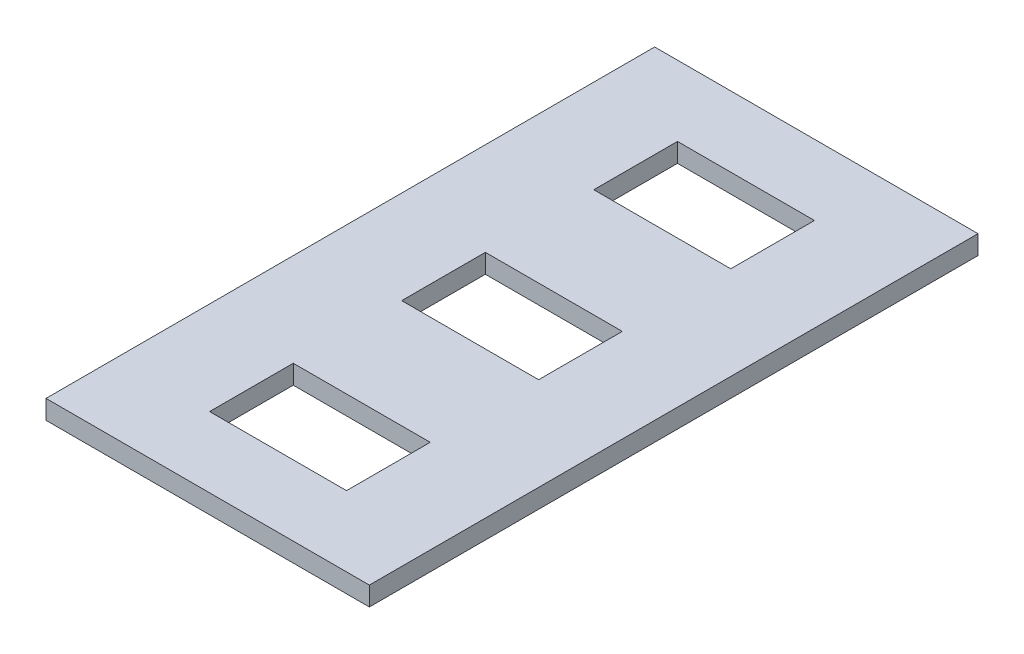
ISO-10303-21;
HEADER;
FILE_DESCRIPTION(('STEP AP214'),'2;1');
FILE_NAME('part.step','',(''),(''),'','','');
FILE_SCHEMA(('AUTOMOTIVE_DESIGN { 1 0 10303 214 1 1 1 1 }'));
ENDSEC;
DATA;
#1=APPLICATION_CONTEXT('core data for automotive mechanical design processes');
#2=APPLICATION_PROTOCOL_DEFINITION('international standard','automotive_design',2000,#1);
#3=PRODUCT_CONTEXT('',#1,'mechanical');
#4=PRODUCT('Part','Part','',(#3));
#5=PRODUCT_RELATED_PRODUCT_CATEGORY('part','',(#4));
#6=PRODUCT_DEFINITION_FORMATION('','',#4);
#7=PRODUCT_DEFINITION_CONTEXT('part definition',#1,'design');
#8=PRODUCT_DEFINITION('design','',#6,#7);
#9=PRODUCT_DEFINITION_SHAPE('','',#8);
#10=(LENGTH_UNIT() NAMED_UNIT(*) SI_UNIT(.MILLI.,.METRE.));
#11=(NAMED_UNIT(*) PLANE_ANGLE_UNIT() SI_UNIT($,.RADIAN.));
#12=(NAMED_UNIT(*) SI_UNIT($,.STERADIAN.) SOLID_ANGLE_UNIT());
#13=UNCERTAINTY_MEASURE_WITH_UNIT(LENGTH_MEASURE(1.E-05),#10,'distance_accuracy_value','');
#14=(GEOMETRIC_REPRESENTATION_CONTEXT(3) GLOBAL_UNCERTAINTY_ASSIGNED_CONTEXT((#13)) GLOBAL_UNIT_ASSIGNED_CONTEXT((#10,
#11,#12)) REPRESENTATION_CONTEXT('',''));
#15=CARTESIAN_POINT('',(0.,0.,0.));
#16=DIRECTION('',(0.,0.,1.));
#17=DIRECTION('',(1.,0.,0.));
#18=AXIS2_PLACEMENT_3D('',#15,#16,#17);
#19=CARTESIAN_POINT('',(0.,5.,0.));
#20=DIRECTION('',(0.,1.,0.));
#21=DIRECTION('',(0.,0.,1.));
#22=AXIS2_PLACEMENT_3D('',#19,#20,#21);
#23=PLANE('',#22);
#24=DIRECTION('',(0.,0.,-1.));
#25=VECTOR('',#24,1.);
#26=CARTESIAN_POINT('',(42.5,5.,-80.));
#27=LINE('',#26,#25);
#28=CARTESIAN_POINT('',(42.5,5.,80.));
#29=VERTEX_POINT('',#28);
#30=CARTESIAN_POINT('',(42.5,5.,-80.));
#31=VERTEX_POINT('',#30);
#32=EDGE_CURVE('E287',#29,#31,#27,.T.);
#33=ORIENTED_EDGE('',*,*,#32,.T.);
#34=DIRECTION('',(-1.,0.,0.));
#35=VECTOR('',#34,1.);
#36=CARTESIAN_POINT('',(-42.5,5.,-80.));
#37=LINE('',#36,#35);
#38=CARTESIAN_POINT('',(-42.5,5.,-80.));
#39=VERTEX_POINT('',#38);
#40=EDGE_CURVE('E291',#31,#39,#37,.T.);
#41=ORIENTED_EDGE('',*,*,#40,.T.);
#42=DIRECTION('',(0.,0.,1.));
#43=VECTOR('',#42,1.);
#44=CARTESIAN_POINT('',(-42.5,5.,-80.));
#45=LINE('',#44,#43);
#46=CARTESIAN_POINT('',(-42.5,5.,80.));
#47=VERTEX_POINT('',#46);
#48=EDGE_CURVE('E295',#39,#47,#45,.T.);
#49=ORIENTED_EDGE('',*,*,#48,.T.);
#50=DIRECTION('',(1.,0.,0.));
#51=VECTOR('',#50,1.);
#52=CARTESIAN_POINT('',(-42.5,5.,80.));
#53=LINE('',#52,#51);
#54=EDGE_CURVE('E298',#47,#29,#53,.T.);
#55=ORIENTED_EDGE('',*,*,#54,.T.);
#56=EDGE_LOOP('',(#33,#41,#49,#55));
#57=FACE_BOUND('',#56,.T.);
#58=DIRECTION('',(-1.,0.,0.));
#59=VECTOR('',#58,1.);
#60=CARTESIAN_POINT('',(-18.,5.,-11.));
#61=LINE('',#60,#59);
#62=CARTESIAN_POINT('',(18.,5.,-11.));
#63=VERTEX_POINT('',#62);
#64=CARTESIAN_POINT('',(-18.,5.,-11.));
#65=VERTEX_POINT('',#64);
#66=EDGE_CURVE('E247',#63,#65,#61,.T.);
#67=ORIENTED_EDGE('',*,*,#66,.F.);
#68=DIRECTION('',(0.,0.,-1.));
#69=VECTOR('',#68,1.);
#70=CARTESIAN_POINT('',(18.,5.,-11.));
#71=LINE('',#70,#69);
#72=CARTESIAN_POINT('',(18.,5.,11.));
#73=VERTEX_POINT('',#72);
#74=EDGE_CURVE('E244',#73,#63,#71,.T.);
#75=ORIENTED_EDGE('',*,*,#74,.F.);
#76=DIRECTION('',(1.,0.,0.));
#77=VECTOR('',#76,1.);
#78=CARTESIAN_POINT('',(-18.,5.,11.));
#79=LINE('',#78,#77);
#80=CARTESIAN_POINT('',(-18.,5.,11.));
#81=VERTEX_POINT('',#80);
#82=EDGE_CURVE('E255',#81,#73,#79,.T.);
#83=ORIENTED_EDGE('',*,*,#82,.F.);
#84=DIRECTION('',(0.,0.,1.));
#85=VECTOR('',#84,1.);
#86=CARTESIAN_POINT('',(-18.,5.,-11.));
#87=LINE('',#86,#85);
#88=EDGE_CURVE('E251',#65,#81,#87,.T.);
#89=ORIENTED_EDGE('',*,*,#88,.F.);
#90=EDGE_LOOP('',(#67,#75,#83,#89));
#91=FACE_BOUND('',#90,.T.);
#92=DIRECTION('',(-1.,0.,0.));
#93=VECTOR('',#92,1.);
#94=CARTESIAN_POINT('',(-18.,5.,-61.5));
#95=LINE('',#94,#93);
#96=CARTESIAN_POINT('',(18.,5.,-61.5));
#97=VERTEX_POINT('',#96);
#98=CARTESIAN_POINT('',(-18.,5.,-61.5));
#99=VERTEX_POINT('',#98);
#100=EDGE_CURVE('E204',#97,#99,#95,.T.);
#101=ORIENTED_EDGE('',*,*,#100,.F.);
#102=DIRECTION('',(0.,0.,-1.));
#103=VECTOR('',#102,1.);
#104=CARTESIAN_POINT('',(18.,5.,-61.5));
#105=LINE('',#104,#103);
#106=CARTESIAN_POINT('',(18.,5.,-39.5));
#107=VERTEX_POINT('',#106);
#108=EDGE_CURVE('E201',#107,#97,#105,.T.);
#109=ORIENTED_EDGE('',*,*,#108,.F.);
#110=DIRECTION('',(1.,0.,0.));
#111=VECTOR('',#110,1.);
#112=CARTESIAN_POINT('',(-18.,5.,-39.5));
#113=LINE('',#112,#111);
#114=CARTESIAN_POINT('',(-18.,5.,-39.5));
#115=VERTEX_POINT('',#114);
#116=EDGE_CURVE('E212',#115,#107,#113,.T.);
#117=ORIENTED_EDGE('',*,*,#116,.F.);
#118=DIRECTION('',(0.,0.,1.));
#119=VECTOR('',#118,1.);
#120=CARTESIAN_POINT('',(-18.,5.,-61.5));
#121=LINE('',#120,#119);
#122=EDGE_CURVE('E208',#99,#115,#121,.T.);
#123=ORIENTED_EDGE('',*,*,#122,.F.);
#124=EDGE_LOOP('',(#101,#109,#117,#123));
#125=FACE_BOUND('',#124,.T.);
#126=DIRECTION('',(-1.,0.,0.));
#127=VECTOR('',#126,1.);
#128=CARTESIAN_POINT('',(-18.,5.,39.5));
#129=LINE('',#128,#127);
#130=CARTESIAN_POINT('',(18.,5.,39.5));
#131=VERTEX_POINT('',#130);
#132=CARTESIAN_POINT('',(-18.,5.,39.5));
#133=VERTEX_POINT('',#132);
#134=EDGE_CURVE('E162',#131,#133,#129,.T.);
#135=ORIENTED_EDGE('',*,*,#134,.F.);
#136=DIRECTION('',(0.,0.,-1.));
#137=VECTOR('',#136,1.);
#138=CARTESIAN_POINT('',(18.,5.,39.5));
#139=LINE('',#138,#137);
#140=CARTESIAN_POINT('',(18.,5.,61.5));
#141=VERTEX_POINT('',#140);
#142=EDGE_CURVE('E153',#141,#131,#139,.T.);
#143=ORIENTED_EDGE('',*,*,#142,.F.);
#144=DIRECTION('',(1.,0.,0.));
#145=VECTOR('',#144,1.);
#146=CARTESIAN_POINT('',(-18.,5.,61.5));
#147=LINE('',#146,#145);
#148=CARTESIAN_POINT('',(-18.,5.,61.5));
#149=VERTEX_POINT('',#148);
#150=EDGE_CURVE('E179',#149,#141,#147,.T.);
#151=ORIENTED_EDGE('',*,*,#150,.F.);
#152=DIRECTION('',(0.,0.,1.));
#153=VECTOR('',#152,1.);
#154=CARTESIAN_POINT('',(-18.,5.,39.5));
#155=LINE('',#154,#153);
#156=EDGE_CURVE('E175',#133,#149,#155,.T.);
#157=ORIENTED_EDGE('',*,*,#156,.F.);
#158=EDGE_LOOP('',(#135,#143,#151,#157));
#159=FACE_BOUND('',#158,.T.);
#160=ADVANCED_FACE('F39',(#57,#91,#125,#159),#23,.T.);
#161=CARTESIAN_POINT('',(0.,0.,0.));
#162=DIRECTION('',(0.,1.,0.));
#163=DIRECTION('',(0.,0.,1.));
#164=AXIS2_PLACEMENT_3D('',#161,#162,#163);
#165=PLANE('',#164);
#166=DIRECTION('',(0.,0.,-1.));
#167=VECTOR('',#166,1.);
#168=CARTESIAN_POINT('',(18.,0.,-61.5));
#169=LINE('',#168,#167);
#170=CARTESIAN_POINT('',(18.,0.,-39.5));
#171=VERTEX_POINT('',#170);
#172=CARTESIAN_POINT('',(18.,0.,-61.5));
#173=VERTEX_POINT('',#172);
#174=EDGE_CURVE('E171',#171,#173,#169,.T.);
#175=ORIENTED_EDGE('',*,*,#174,.T.);
#176=DIRECTION('',(-1.,0.,0.));
#177=VECTOR('',#176,1.);
#178=CARTESIAN_POINT('',(-18.,0.,-61.5));
#179=LINE('',#178,#177);
#180=CARTESIAN_POINT('',(-18.,0.,-61.5));
#181=VERTEX_POINT('',#180);
#182=EDGE_CURVE('E219',#173,#181,#179,.T.);
#183=ORIENTED_EDGE('',*,*,#182,.T.);
#184=DIRECTION('',(0.,0.,1.));
#185=VECTOR('',#184,1.);
#186=CARTESIAN_POINT('',(-18.,0.,-61.5));
#187=LINE('',#186,#185);
#188=CARTESIAN_POINT('',(-18.,0.,-39.5));
#189=VERTEX_POINT('',#188);
#190=EDGE_CURVE('E223',#181,#189,#187,.T.);
#191=ORIENTED_EDGE('',*,*,#190,.T.);
#192=DIRECTION('',(1.,0.,0.));
#193=VECTOR('',#192,1.);
#194=CARTESIAN_POINT('',(-18.,0.,-39.5));
#195=LINE('',#194,#193);
#196=EDGE_CURVE('E205',#189,#171,#195,.T.);
#197=ORIENTED_EDGE('',*,*,#196,.T.);
#198=EDGE_LOOP('',(#175,#183,#191,#197));
#199=FACE_BOUND('',#198,.T.);
#200=DIRECTION('',(0.,0.,-1.));
#201=VECTOR('',#200,1.);
#202=CARTESIAN_POINT('',(42.5,0.,-80.));
#203=LINE('',#202,#201);
#204=CARTESIAN_POINT('',(42.5,0.,80.));
#205=VERTEX_POINT('',#204);
#206=CARTESIAN_POINT('',(42.5,0.,-80.));
#207=VERTEX_POINT('',#206);
#208=EDGE_CURVE('E286',#205,#207,#203,.T.);
#209=ORIENTED_EDGE('',*,*,#208,.F.);
#210=DIRECTION('',(1.,0.,0.));
#211=VECTOR('',#210,1.);
#212=CARTESIAN_POINT('',(-42.5,0.,80.));
#213=LINE('',#212,#211);
#214=CARTESIAN_POINT('',(-42.5,0.,80.));
#215=VERTEX_POINT('',#214);
#216=EDGE_CURVE('E292',#215,#205,#213,.T.);
#217=ORIENTED_EDGE('',*,*,#216,.F.);
#218=DIRECTION('',(0.,0.,1.));
#219=VECTOR('',#218,1.);
#220=CARTESIAN_POINT('',(-42.5,0.,-80.));
#221=LINE('',#220,#219);
#222=CARTESIAN_POINT('',(-42.5,0.,-80.));
#223=VERTEX_POINT('',#222);
#224=EDGE_CURVE('E308',#223,#215,#221,.T.);
#225=ORIENTED_EDGE('',*,*,#224,.F.);
#226=DIRECTION('',(-1.,0.,0.));
#227=VECTOR('',#226,1.);
#228=CARTESIAN_POINT('',(-42.5,0.,-80.));
#229=LINE('',#228,#227);
#230=EDGE_CURVE('E305',#207,#223,#229,.T.);
#231=ORIENTED_EDGE('',*,*,#230,.F.);
#232=EDGE_LOOP('',(#209,#217,#225,#231));
#233=FACE_BOUND('',#232,.T.);
#234=DIRECTION('',(0.,0.,-1.));
#235=VECTOR('',#234,1.);
#236=CARTESIAN_POINT('',(18.,0.,-11.));
#237=LINE('',#236,#235);
#238=CARTESIAN_POINT('',(18.,0.,11.));
#239=VERTEX_POINT('',#238);
#240=CARTESIAN_POINT('',(18.,0.,-11.));
#241=VERTEX_POINT('',#240);
#242=EDGE_CURVE('E243',#239,#241,#237,.T.);
#243=ORIENTED_EDGE('',*,*,#242,.T.);
#244=DIRECTION('',(-1.,0.,0.));
#245=VECTOR('',#244,1.);
#246=CARTESIAN_POINT('',(-18.,0.,-11.));
#247=LINE('',#246,#245);
#248=CARTESIAN_POINT('',(-18.,0.,-11.));
#249=VERTEX_POINT('',#248);
#250=EDGE_CURVE('E262',#241,#249,#247,.T.);
#251=ORIENTED_EDGE('',*,*,#250,.T.);
#252=DIRECTION('',(0.,0.,1.));
#253=VECTOR('',#252,1.);
#254=CARTESIAN_POINT('',(-18.,0.,-11.));
#255=LINE('',#254,#253);
#256=CARTESIAN_POINT('',(-18.,0.,11.));
#257=VERTEX_POINT('',#256);
#258=EDGE_CURVE('E266',#249,#257,#255,.T.);
#259=ORIENTED_EDGE('',*,*,#258,.T.);
#260=DIRECTION('',(1.,0.,0.));
#261=VECTOR('',#260,1.);
#262=CARTESIAN_POINT('',(-18.,0.,11.));
#263=LINE('',#262,#261);
#264=EDGE_CURVE('E248',#257,#239,#263,.T.);
#265=ORIENTED_EDGE('',*,*,#264,.T.);
#266=EDGE_LOOP('',(#243,#251,#259,#265));
#267=FACE_BOUND('',#266,.T.);
#268=DIRECTION('',(0.,0.,-1.));
#269=VECTOR('',#268,1.);
#270=CARTESIAN_POINT('',(18.,0.,39.5));
#271=LINE('',#270,#269);
#272=CARTESIAN_POINT('',(18.,0.,61.5));
#273=VERTEX_POINT('',#272);
#274=CARTESIAN_POINT('',(18.,0.,39.5));
#275=VERTEX_POINT('',#274);
#276=EDGE_CURVE('E63',#273,#275,#271,.T.);
#277=ORIENTED_EDGE('',*,*,#276,.T.);
#278=DIRECTION('',(-1.,0.,0.));
#279=VECTOR('',#278,1.);
#280=CARTESIAN_POINT('',(-18.,0.,39.5));
#281=LINE('',#280,#279);
#282=CARTESIAN_POINT('',(-18.,0.,39.5));
#283=VERTEX_POINT('',#282);
#284=EDGE_CURVE('E169',#275,#283,#281,.T.);
#285=ORIENTED_EDGE('',*,*,#284,.T.);
#286=DIRECTION('',(0.,0.,1.));
#287=VECTOR('',#286,1.);
#288=CARTESIAN_POINT('',(-18.,0.,39.5));
#289=LINE('',#288,#287);
#290=CARTESIAN_POINT('',(-18.,0.,61.5));
#291=VERTEX_POINT('',#290);
#292=EDGE_CURVE('E188',#283,#291,#289,.T.);
#293=ORIENTED_EDGE('',*,*,#292,.T.);
#294=DIRECTION('',(1.,0.,0.));
#295=VECTOR('',#294,1.);
#296=CARTESIAN_POINT('',(-18.,0.,61.5));
#297=LINE('',#296,#295);
#298=EDGE_CURVE('E163',#291,#273,#297,.T.);
#299=ORIENTED_EDGE('',*,*,#298,.T.);
#300=EDGE_LOOP('',(#277,#285,#293,#299));
#301=FACE_BOUND('',#300,.T.);
#302=ADVANCED_FACE('F331',(#199,#233,#267,#301),#165,.F.);
#303=CARTESIAN_POINT('',(42.5,5.,-80.));
#304=DIRECTION('',(-1.,0.,0.));
#305=DIRECTION('',(0.,0.,1.));
#306=AXIS2_PLACEMENT_3D('',#303,#304,#305);
#307=PLANE('',#306);
#308=ORIENTED_EDGE('',*,*,#208,.T.);
#309=DIRECTION('',(0.,-1.,0.));
#310=VECTOR('',#309,1.);
#311=CARTESIAN_POINT('',(42.5,5.,-80.));
#312=LINE('',#311,#310);
#313=EDGE_CURVE('E11',#31,#207,#312,.T.);
#314=ORIENTED_EDGE('',*,*,#313,.F.);
#315=ORIENTED_EDGE('',*,*,#32,.F.);
#316=DIRECTION('',(0.,-1.,0.));
#317=VECTOR('',#316,1.);
#318=CARTESIAN_POINT('',(42.5,5.,80.));
#319=LINE('',#318,#317);
#320=EDGE_CURVE('E301',#29,#205,#319,.T.);
#321=ORIENTED_EDGE('',*,*,#320,.T.);
#322=EDGE_LOOP('',(#308,#314,#315,#321));
#323=FACE_BOUND('',#322,.T.);
#324=ADVANCED_FACE('F41',(#323),#307,.F.);
#325=CARTESIAN_POINT('',(-42.5,5.,-80.));
#326=DIRECTION('',(0.,0.,1.));
#327=DIRECTION('',(1.,0.,0.));
#328=AXIS2_PLACEMENT_3D('',#325,#326,#327);
#329=PLANE('',#328);
#330=ORIENTED_EDGE('',*,*,#230,.T.);
#331=DIRECTION('',(0.,-1.,0.));
#332=VECTOR('',#331,1.);
#333=CARTESIAN_POINT('',(-42.5,5.,-80.));
#334=LINE('',#333,#332);
#335=EDGE_CURVE('E48',#39,#223,#334,.T.);
#336=ORIENTED_EDGE('',*,*,#335,.F.);
#337=ORIENTED_EDGE('',*,*,#40,.F.);
#338=ORIENTED_EDGE('',*,*,#313,.T.);
#339=EDGE_LOOP('',(#330,#336,#337,#338));
#340=FACE_BOUND('',#339,.T.);
#341=ADVANCED_FACE('F342',(#340),#329,.F.);
#342=CARTESIAN_POINT('',(-42.5,5.,-80.));
#343=DIRECTION('',(1.,0.,0.));
#344=DIRECTION('',(0.,0.,-1.));
#345=AXIS2_PLACEMENT_3D('',#342,#343,#344);
#346=PLANE('',#345);
#347=ORIENTED_EDGE('',*,*,#224,.T.);
#348=DIRECTION('',(0.,-1.,0.));
#349=VECTOR('',#348,1.);
#350=CARTESIAN_POINT('',(-42.5,5.,80.));
#351=LINE('',#350,#349);
#352=EDGE_CURVE('E316',#47,#215,#351,.T.);
#353=ORIENTED_EDGE('',*,*,#352,.F.);
#354=ORIENTED_EDGE('',*,*,#48,.F.);
#355=ORIENTED_EDGE('',*,*,#335,.T.);
#356=EDGE_LOOP('',(#347,#353,#354,#355));
#357=FACE_BOUND('',#356,.T.);
#358=ADVANCED_FACE('F325',(#357),#346,.F.);
#359=CARTESIAN_POINT('',(-42.5,5.,80.));
#360=DIRECTION('',(0.,0.,-1.));
#361=DIRECTION('',(-1.,0.,0.));
#362=AXIS2_PLACEMENT_3D('',#359,#360,#361);
#363=PLANE('',#362);
#364=ORIENTED_EDGE('',*,*,#216,.T.);
#365=ORIENTED_EDGE('',*,*,#320,.F.);
#366=ORIENTED_EDGE('',*,*,#54,.F.);
#367=ORIENTED_EDGE('',*,*,#352,.T.);
#368=EDGE_LOOP('',(#364,#365,#366,#367));
#369=FACE_BOUND('',#368,.T.);
#370=ADVANCED_FACE('F335',(#369),#363,.F.);
#371=CARTESIAN_POINT('',(18.,5.,-11.));
#372=DIRECTION('',(-1.,0.,0.));
#373=DIRECTION('',(0.,0.,1.));
#374=AXIS2_PLACEMENT_3D('',#371,#372,#373);
#375=PLANE('',#374);
#376=ORIENTED_EDGE('',*,*,#242,.F.);
#377=DIRECTION('',(0.,-1.,0.));
#378=VECTOR('',#377,1.);
#379=CARTESIAN_POINT('',(18.,5.,11.));
#380=LINE('',#379,#378);
#381=EDGE_CURVE('E258',#73,#239,#380,.T.);
#382=ORIENTED_EDGE('',*,*,#381,.F.);
#383=ORIENTED_EDGE('',*,*,#74,.T.);
#384=DIRECTION('',(0.,-1.,0.));
#385=VECTOR('',#384,1.);
#386=CARTESIAN_POINT('',(18.,5.,-11.));
#387=LINE('',#386,#385);
#388=EDGE_CURVE('E282',#63,#241,#387,.T.);
#389=ORIENTED_EDGE('',*,*,#388,.T.);
#390=EDGE_LOOP('',(#376,#382,#383,#389));
#391=FACE_BOUND('',#390,.T.);
#392=ADVANCED_FACE('F357',(#391),#375,.T.);
#393=CARTESIAN_POINT('',(-18.,5.,-11.));
#394=DIRECTION('',(0.,0.,1.));
#395=DIRECTION('',(1.,0.,0.));
#396=AXIS2_PLACEMENT_3D('',#393,#394,#395);
#397=PLANE('',#396);
#398=ORIENTED_EDGE('',*,*,#250,.F.);
#399=ORIENTED_EDGE('',*,*,#388,.F.);
#400=ORIENTED_EDGE('',*,*,#66,.T.);
#401=DIRECTION('',(0.,-1.,0.));
#402=VECTOR('',#401,1.);
#403=CARTESIAN_POINT('',(-18.,5.,-11.));
#404=LINE('',#403,#402);
#405=EDGE_CURVE('E279',#65,#249,#404,.T.);
#406=ORIENTED_EDGE('',*,*,#405,.T.);
#407=EDGE_LOOP('',(#398,#399,#400,#406));
#408=FACE_BOUND('',#407,.T.);
#409=ADVANCED_FACE('F364',(#408),#397,.T.);
#410=CARTESIAN_POINT('',(-18.,5.,-11.));
#411=DIRECTION('',(1.,0.,0.));
#412=DIRECTION('',(0.,0.,-1.));
#413=AXIS2_PLACEMENT_3D('',#410,#411,#412);
#414=PLANE('',#413);
#415=ORIENTED_EDGE('',*,*,#258,.F.);
#416=ORIENTED_EDGE('',*,*,#405,.F.);
#417=ORIENTED_EDGE('',*,*,#88,.T.);
#418=DIRECTION('',(0.,-1.,0.));
#419=VECTOR('',#418,1.);
#420=CARTESIAN_POINT('',(-18.,5.,11.));
#421=LINE('',#420,#419);
#422=EDGE_CURVE('E276',#81,#257,#421,.T.);
#423=ORIENTED_EDGE('',*,*,#422,.T.);
#424=EDGE_LOOP('',(#415,#416,#417,#423));
#425=FACE_BOUND('',#424,.T.);
#426=ADVANCED_FACE('F369',(#425),#414,.T.);
#427=CARTESIAN_POINT('',(-18.,5.,11.));
#428=DIRECTION('',(0.,0.,-1.));
#429=DIRECTION('',(-1.,0.,0.));
#430=AXIS2_PLACEMENT_3D('',#427,#428,#429);
#431=PLANE('',#430);
#432=ORIENTED_EDGE('',*,*,#264,.F.);
#433=ORIENTED_EDGE('',*,*,#422,.F.);
#434=ORIENTED_EDGE('',*,*,#82,.T.);
#435=ORIENTED_EDGE('',*,*,#381,.T.);
#436=EDGE_LOOP('',(#432,#433,#434,#435));
#437=FACE_BOUND('',#436,.T.);
#438=ADVANCED_FACE('F376',(#437),#431,.T.);
#439=CARTESIAN_POINT('',(18.,5.,-61.5));
#440=DIRECTION('',(-1.,0.,0.));
#441=DIRECTION('',(0.,0.,1.));
#442=AXIS2_PLACEMENT_3D('',#439,#440,#441);
#443=PLANE('',#442);
#444=ORIENTED_EDGE('',*,*,#174,.F.);
#445=DIRECTION('',(0.,-1.,0.));
#446=VECTOR('',#445,1.);
#447=CARTESIAN_POINT('',(18.,5.,-39.5));
#448=LINE('',#447,#446);
#449=EDGE_CURVE('E215',#107,#171,#448,.T.);
#450=ORIENTED_EDGE('',*,*,#449,.F.);
#451=ORIENTED_EDGE('',*,*,#108,.T.);
#452=DIRECTION('',(0.,-1.,0.));
#453=VECTOR('',#452,1.);
#454=CARTESIAN_POINT('',(18.,5.,-61.5));
#455=LINE('',#454,#453);
#456=EDGE_CURVE('E239',#97,#173,#455,.T.);
#457=ORIENTED_EDGE('',*,*,#456,.T.);
#458=EDGE_LOOP('',(#444,#450,#451,#457));
#459=FACE_BOUND('',#458,.T.);
#460=ADVANCED_FACE('F398',(#459),#443,.T.);
#461=CARTESIAN_POINT('',(-18.,5.,-61.5));
#462=DIRECTION('',(0.,0.,1.));
#463=DIRECTION('',(1.,0.,0.));
#464=AXIS2_PLACEMENT_3D('',#461,#462,#463);
#465=PLANE('',#464);
#466=ORIENTED_EDGE('',*,*,#182,.F.);
#467=ORIENTED_EDGE('',*,*,#456,.F.);
#468=ORIENTED_EDGE('',*,*,#100,.T.);
#469=DIRECTION('',(0.,-1.,0.));
#470=VECTOR('',#469,1.);
#471=CARTESIAN_POINT('',(-18.,5.,-61.5));
#472=LINE('',#471,#470);
#473=EDGE_CURVE('E236',#99,#181,#472,.T.);
#474=ORIENTED_EDGE('',*,*,#473,.T.);
#475=EDGE_LOOP('',(#466,#467,#468,#474));
#476=FACE_BOUND('',#475,.T.);
#477=ADVANCED_FACE('F392',(#476),#465,.T.);
#478=CARTESIAN_POINT('',(-18.,5.,-61.5));
#479=DIRECTION('',(1.,0.,0.));
#480=DIRECTION('',(0.,0.,-1.));
#481=AXIS2_PLACEMENT_3D('',#478,#479,#480);
#482=PLANE('',#481);
#483=ORIENTED_EDGE('',*,*,#190,.F.);
#484=ORIENTED_EDGE('',*,*,#473,.F.);
#485=ORIENTED_EDGE('',*,*,#122,.T.);
#486=DIRECTION('',(0.,-1.,0.));
#487=VECTOR('',#486,1.);
#488=CARTESIAN_POINT('',(-18.,5.,-39.5));
#489=LINE('',#488,#487);
#490=EDGE_CURVE('E233',#115,#189,#489,.T.);
#491=ORIENTED_EDGE('',*,*,#490,.T.);
#492=EDGE_LOOP('',(#483,#484,#485,#491));
#493=FACE_BOUND('',#492,.T.);
#494=ADVANCED_FACE('F395',(#493),#482,.T.);
#495=CARTESIAN_POINT('',(-18.,5.,-39.5));
#496=DIRECTION('',(0.,0.,-1.));
#497=DIRECTION('',(-1.,0.,0.));
#498=AXIS2_PLACEMENT_3D('',#495,#496,#497);
#499=PLANE('',#498);
#500=ORIENTED_EDGE('',*,*,#196,.F.);
#501=ORIENTED_EDGE('',*,*,#490,.F.);
#502=ORIENTED_EDGE('',*,*,#116,.T.);
#503=ORIENTED_EDGE('',*,*,#449,.T.);
#504=EDGE_LOOP('',(#500,#501,#502,#503));
#505=FACE_BOUND('',#504,.T.);
#506=ADVANCED_FACE('F401',(#505),#499,.T.);
#507=CARTESIAN_POINT('',(18.,5.,39.5));
#508=DIRECTION('',(-1.,0.,0.));
#509=DIRECTION('',(0.,0.,1.));
#510=AXIS2_PLACEMENT_3D('',#507,#508,#509);
#511=PLANE('',#510);
#512=ORIENTED_EDGE('',*,*,#276,.F.);
#513=DIRECTION('',(0.,-1.,0.));
#514=VECTOR('',#513,1.);
#515=CARTESIAN_POINT('',(18.,5.,61.5));
#516=LINE('',#515,#514);
#517=EDGE_CURVE('E157',#141,#273,#516,.T.);
#518=ORIENTED_EDGE('',*,*,#517,.F.);
#519=ORIENTED_EDGE('',*,*,#142,.T.);
#520=DIRECTION('',(0.,-1.,0.));
#521=VECTOR('',#520,1.);
#522=CARTESIAN_POINT('',(18.,5.,39.5));
#523=LINE('',#522,#521);
#524=EDGE_CURVE('E156',#131,#275,#523,.T.);
#525=ORIENTED_EDGE('',*,*,#524,.T.);
#526=EDGE_LOOP('',(#512,#518,#519,#525));
#527=FACE_BOUND('',#526,.T.);
#528=ADVANCED_FACE('F155',(#527),#511,.T.);
#529=CARTESIAN_POINT('',(-18.,5.,39.5));
#530=DIRECTION('',(0.,0.,1.));
#531=DIRECTION('',(1.,0.,0.));
#532=AXIS2_PLACEMENT_3D('',#529,#530,#531);
#533=PLANE('',#532);
#534=ORIENTED_EDGE('',*,*,#284,.F.);
#535=ORIENTED_EDGE('',*,*,#524,.F.);
#536=ORIENTED_EDGE('',*,*,#134,.T.);
#537=DIRECTION('',(0.,-1.,0.));
#538=VECTOR('',#537,1.);
#539=CARTESIAN_POINT('',(-18.,5.,39.5));
#540=LINE('',#539,#538);
#541=EDGE_CURVE('E172',#133,#283,#540,.T.);
#542=ORIENTED_EDGE('',*,*,#541,.T.);
#543=EDGE_LOOP('',(#534,#535,#536,#542));
#544=FACE_BOUND('',#543,.T.);
#545=ADVANCED_FACE('F166',(#544),#533,.T.);
#546=CARTESIAN_POINT('',(-18.,5.,39.5));
#547=DIRECTION('',(1.,0.,0.));
#548=DIRECTION('',(0.,0.,-1.));
#549=AXIS2_PLACEMENT_3D('',#546,#547,#548);
#550=PLANE('',#549);
#551=ORIENTED_EDGE('',*,*,#292,.F.);
#552=ORIENTED_EDGE('',*,*,#541,.F.);
#553=ORIENTED_EDGE('',*,*,#156,.T.);
#554=DIRECTION('',(0.,-1.,0.));
#555=VECTOR('',#554,1.);
#556=CARTESIAN_POINT('',(-18.,5.,61.5));
#557=LINE('',#556,#555);
#558=EDGE_CURVE('E55',#149,#291,#557,.T.);
#559=ORIENTED_EDGE('',*,*,#558,.T.);
#560=EDGE_LOOP('',(#551,#552,#553,#559));
#561=FACE_BOUND('',#560,.T.);
#562=ADVANCED_FACE('F458',(#561),#550,.T.);
#563=CARTESIAN_POINT('',(-18.,5.,61.5));
#564=DIRECTION('',(0.,0.,-1.));
#565=DIRECTION('',(-1.,0.,0.));
#566=AXIS2_PLACEMENT_3D('',#563,#564,#565);
#567=PLANE('',#566);
#568=ORIENTED_EDGE('',*,*,#298,.F.);
#569=ORIENTED_EDGE('',*,*,#558,.F.);
#570=ORIENTED_EDGE('',*,*,#150,.T.);
#571=ORIENTED_EDGE('',*,*,#517,.T.);
#572=EDGE_LOOP('',(#568,#569,#570,#571));
#573=FACE_BOUND('',#572,.T.);
#574=ADVANCED_FACE('F466',(#573),#567,.T.);
#575=CLOSED_SHELL('',(#160,#302,#324,#341,#358,#370,#392,#409,#426,#438,#460,#477,#494,#506,
#528,#545,#562,#574));
#576=MANIFOLD_SOLID_BREP('B2',#575);
#577=ADVANCED_BREP_SHAPE_REPRESENTATION('',(#18,#576),#14);
#578=SHAPE_DEFINITION_REPRESENTATION(#9,#577);
ENDSEC;
END-ISO-10303-21;
